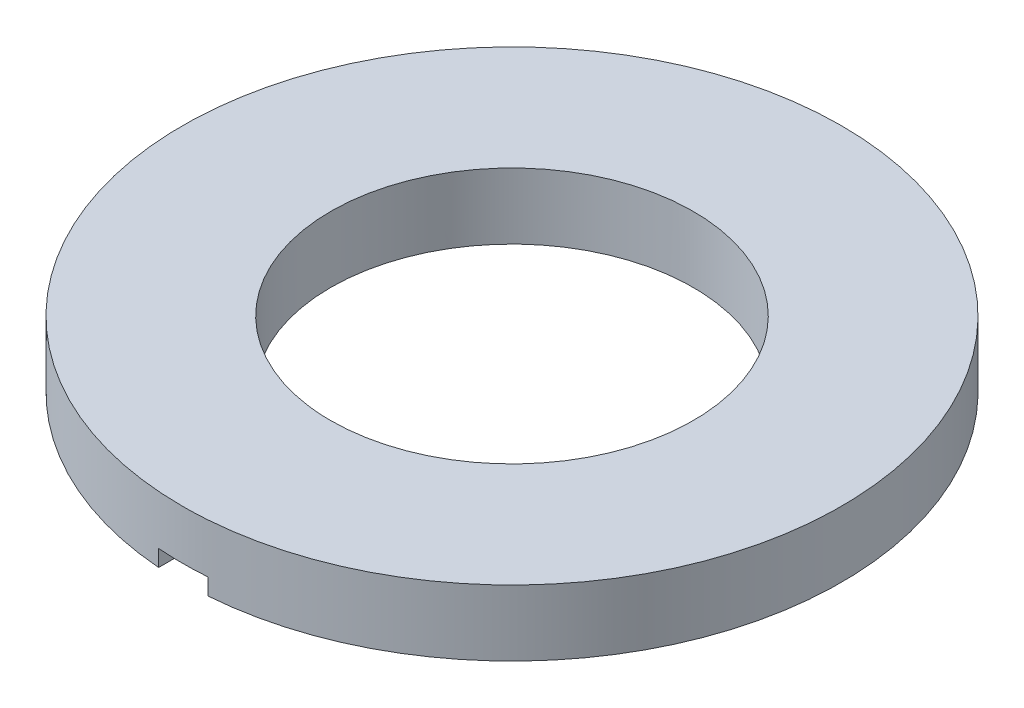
ISO-10303-21;
HEADER;
FILE_DESCRIPTION(('STEP AP214'),'2;1');
FILE_NAME('part.step','',(''),(''),'','','');
FILE_SCHEMA(('AUTOMOTIVE_DESIGN { 1 0 10303 214 1 1 1 1 }'));
ENDSEC;
DATA;
#1=APPLICATION_CONTEXT('core data for automotive mechanical design processes');
#2=APPLICATION_PROTOCOL_DEFINITION('international standard','automotive_design',2000,#1);
#3=PRODUCT_CONTEXT('',#1,'mechanical');
#4=PRODUCT('Part','Part','',(#3));
#5=PRODUCT_RELATED_PRODUCT_CATEGORY('part','',(#4));
#6=PRODUCT_DEFINITION_FORMATION('','',#4);
#7=PRODUCT_DEFINITION_CONTEXT('part definition',#1,'design');
#8=PRODUCT_DEFINITION('design','',#6,#7);
#9=PRODUCT_DEFINITION_SHAPE('','',#8);
#10=(LENGTH_UNIT() NAMED_UNIT(*) SI_UNIT(.MILLI.,.METRE.));
#11=(NAMED_UNIT(*) PLANE_ANGLE_UNIT() SI_UNIT($,.RADIAN.));
#12=(NAMED_UNIT(*) SI_UNIT($,.STERADIAN.) SOLID_ANGLE_UNIT());
#13=UNCERTAINTY_MEASURE_WITH_UNIT(LENGTH_MEASURE(1.E-05),#10,'distance_accuracy_value','');
#14=(GEOMETRIC_REPRESENTATION_CONTEXT(3) GLOBAL_UNCERTAINTY_ASSIGNED_CONTEXT((#13)) GLOBAL_UNIT_ASSIGNED_CONTEXT((#10,
#11,#12)) REPRESENTATION_CONTEXT('',''));
#15=CARTESIAN_POINT('',(0.,0.,0.));
#16=DIRECTION('',(0.,0.,1.));
#17=DIRECTION('',(1.,0.,0.));
#18=AXIS2_PLACEMENT_3D('',#15,#16,#17);
#19=CARTESIAN_POINT('',(0.,2.,0.));
#20=DIRECTION('',(0.,1.,0.));
#21=DIRECTION('',(0.,0.,1.));
#22=AXIS2_PLACEMENT_3D('',#19,#20,#21);
#23=PLANE('',#22);
#24=CARTESIAN_POINT('',(0.,2.,0.));
#25=DIRECTION('',(0.,1.,0.));
#26=DIRECTION('',(0.,0.,1.));
#27=AXIS2_PLACEMENT_3D('',#24,#25,#26);
#28=CIRCLE('',#27,10.);
#29=CARTESIAN_POINT('',(0.,2.,10.));
#30=VERTEX_POINT('',#29);
#31=EDGE_CURVE('E114',#30,#30,#28,.T.);
#32=ORIENTED_EDGE('',*,*,#31,.T.);
#33=EDGE_LOOP('',(#32));
#34=FACE_BOUND('',#33,.T.);
#35=CARTESIAN_POINT('',(0.,2.,0.));
#36=DIRECTION('',(0.,1.,0.));
#37=DIRECTION('',(0.,0.,1.));
#38=AXIS2_PLACEMENT_3D('',#35,#36,#37);
#39=CIRCLE('',#38,5.5);
#40=CARTESIAN_POINT('',(0.,2.,5.5));
#41=VERTEX_POINT('',#40);
#42=EDGE_CURVE('E102',#41,#41,#39,.T.);
#43=ORIENTED_EDGE('',*,*,#42,.F.);
#44=EDGE_LOOP('',(#43));
#45=FACE_BOUND('',#44,.T.);
#46=ADVANCED_FACE('F39',(#34,#45),#23,.T.);
#47=CARTESIAN_POINT('',(0.,0.,0.));
#48=DIRECTION('',(0.,1.,0.));
#49=DIRECTION('',(0.,0.,1.));
#50=AXIS2_PLACEMENT_3D('',#47,#48,#49);
#51=PLANE('',#50);
#52=CARTESIAN_POINT('',(0.,0.,0.));
#53=DIRECTION('',(0.,1.,0.));
#54=DIRECTION('',(0.,0.,1.));
#55=AXIS2_PLACEMENT_3D('',#52,#53,#54);
#56=CIRCLE('',#55,10.);
#57=CARTESIAN_POINT('',(0.75,0.,9.97183533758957));
#58=VERTEX_POINT('',#57);
#59=CARTESIAN_POINT('',(-0.75,0.,9.97183533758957));
#60=VERTEX_POINT('',#59);
#61=EDGE_CURVE('E94',#58,#60,#56,.T.);
#62=ORIENTED_EDGE('',*,*,#61,.F.);
#63=DIRECTION('',(0.,0.,1.));
#64=VECTOR('',#63,1.);
#65=CARTESIAN_POINT('',(0.75,0.,0.999999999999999));
#66=LINE('',#65,#64);
#67=CARTESIAN_POINT('',(0.75,0.,5.44862367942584));
#68=VERTEX_POINT('',#67);
#69=EDGE_CURVE('E81',#68,#58,#66,.T.);
#70=ORIENTED_EDGE('',*,*,#69,.F.);
#71=CARTESIAN_POINT('',(0.,0.,0.));
#72=DIRECTION('',(0.,1.,0.));
#73=DIRECTION('',(0.,0.,1.));
#74=AXIS2_PLACEMENT_3D('',#71,#72,#73);
#75=CIRCLE('',#74,5.5);
#76=CARTESIAN_POINT('',(-0.75,0.,5.44862367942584));
#77=VERTEX_POINT('',#76);
#78=EDGE_CURVE('E92',#68,#77,#75,.T.);
#79=ORIENTED_EDGE('',*,*,#78,.T.);
#80=DIRECTION('',(0.,0.,-1.));
#81=VECTOR('',#80,1.);
#82=CARTESIAN_POINT('',(-0.75,0.,0.999999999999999));
#83=LINE('',#82,#81);
#84=EDGE_CURVE('E96',#60,#77,#83,.T.);
#85=ORIENTED_EDGE('',*,*,#84,.F.);
#86=EDGE_LOOP('',(#62,#70,#79,#85));
#87=FACE_BOUND('',#86,.T.);
#88=ADVANCED_FACE('F90',(#87),#51,.F.);
#89=CARTESIAN_POINT('',(0.,2.,0.));
#90=DIRECTION('',(0.,-1.,0.));
#91=DIRECTION('',(0.,0.,-1.));
#92=AXIS2_PLACEMENT_3D('',#89,#90,#91);
#93=CYLINDRICAL_SURFACE('',#92,10.);
#94=ORIENTED_EDGE('',*,*,#31,.F.);
#95=EDGE_LOOP('',(#94));
#96=FACE_BOUND('',#95,.T.);
#97=CARTESIAN_POINT('',(0.,0.5,0.));
#98=DIRECTION('',(0.,1.,0.));
#99=DIRECTION('',(0.,0.,1.));
#100=AXIS2_PLACEMENT_3D('',#97,#98,#99);
#101=CIRCLE('',#100,10.);
#102=CARTESIAN_POINT('',(-0.75,0.5,9.97183533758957));
#103=VERTEX_POINT('',#102);
#104=CARTESIAN_POINT('',(0.75,0.5,9.97183533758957));
#105=VERTEX_POINT('',#104);
#106=EDGE_CURVE('E60',#103,#105,#101,.T.);
#107=ORIENTED_EDGE('',*,*,#106,.T.);
#108=DIRECTION('',(0.,-1.,0.));
#109=VECTOR('',#108,1.);
#110=CARTESIAN_POINT('',(0.75,2.,9.97183533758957));
#111=LINE('',#110,#109);
#112=EDGE_CURVE('E103',#105,#58,#111,.T.);
#113=ORIENTED_EDGE('',*,*,#112,.T.);
#114=ORIENTED_EDGE('',*,*,#61,.T.);
#115=DIRECTION('',(0.,-1.,0.));
#116=VECTOR('',#115,1.);
#117=CARTESIAN_POINT('',(-0.75,2.,9.97183533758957));
#118=LINE('',#117,#116);
#119=EDGE_CURVE('E111',#60,#103,#118,.F.);
#120=ORIENTED_EDGE('',*,*,#119,.T.);
#121=EDGE_LOOP('',(#107,#113,#114,#120));
#122=FACE_BOUND('',#121,.T.);
#123=ADVANCED_FACE('F41',(#96,#122),#93,.T.);
#124=CARTESIAN_POINT('',(0.,2.,0.));
#125=DIRECTION('',(0.,-1.,0.));
#126=DIRECTION('',(0.,0.,-1.));
#127=AXIS2_PLACEMENT_3D('',#124,#125,#126);
#128=CYLINDRICAL_SURFACE('',#127,5.5);
#129=DIRECTION('',(0.,-1.,0.));
#130=VECTOR('',#129,1.);
#131=CARTESIAN_POINT('',(0.75,2.,5.44862367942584));
#132=LINE('',#131,#130);
#133=CARTESIAN_POINT('',(0.75,0.5,5.44862367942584));
#134=VERTEX_POINT('',#133);
#135=EDGE_CURVE('E11',#134,#68,#132,.T.);
#136=ORIENTED_EDGE('',*,*,#135,.F.);
#137=CARTESIAN_POINT('',(0.,0.5,0.));
#138=DIRECTION('',(0.,1.,0.));
#139=DIRECTION('',(0.,0.,1.));
#140=AXIS2_PLACEMENT_3D('',#137,#138,#139);
#141=CIRCLE('',#140,5.5);
#142=CARTESIAN_POINT('',(-0.75,0.5,5.44862367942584));
#143=VERTEX_POINT('',#142);
#144=EDGE_CURVE('E118',#143,#134,#141,.T.);
#145=ORIENTED_EDGE('',*,*,#144,.F.);
#146=DIRECTION('',(0.,-1.,0.));
#147=VECTOR('',#146,1.);
#148=CARTESIAN_POINT('',(-0.75,2.,5.44862367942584));
#149=LINE('',#148,#147);
#150=EDGE_CURVE('E48',#77,#143,#149,.F.);
#151=ORIENTED_EDGE('',*,*,#150,.F.);
#152=ORIENTED_EDGE('',*,*,#78,.F.);
#153=EDGE_LOOP('',(#136,#145,#151,#152));
#154=FACE_BOUND('',#153,.T.);
#155=ORIENTED_EDGE('',*,*,#42,.T.);
#156=EDGE_LOOP('',(#155));
#157=FACE_BOUND('',#156,.T.);
#158=ADVANCED_FACE('F99',(#154,#157),#128,.F.);
#159=CARTESIAN_POINT('',(0.75,0.5,0.999999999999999));
#160=DIRECTION('',(1.,0.,0.));
#161=DIRECTION('',(0.,0.,-1.));
#162=AXIS2_PLACEMENT_3D('',#159,#160,#161);
#163=PLANE('',#162);
#164=DIRECTION('',(0.,0.,1.));
#165=VECTOR('',#164,1.);
#166=CARTESIAN_POINT('',(0.75,0.5,0.999999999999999));
#167=LINE('',#166,#165);
#168=EDGE_CURVE('E83',#134,#105,#167,.T.);
#169=ORIENTED_EDGE('',*,*,#168,.F.);
#170=ORIENTED_EDGE('',*,*,#135,.T.);
#171=ORIENTED_EDGE('',*,*,#69,.T.);
#172=ORIENTED_EDGE('',*,*,#112,.F.);
#173=EDGE_LOOP('',(#169,#170,#171,#172));
#174=FACE_BOUND('',#173,.T.);
#175=ADVANCED_FACE('F79',(#174),#163,.F.);
#176=CARTESIAN_POINT('',(-0.75,0.5,0.999999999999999));
#177=DIRECTION('',(-1.,0.,0.));
#178=DIRECTION('',(0.,0.,1.));
#179=AXIS2_PLACEMENT_3D('',#176,#177,#178);
#180=PLANE('',#179);
#181=ORIENTED_EDGE('',*,*,#84,.T.);
#182=ORIENTED_EDGE('',*,*,#150,.T.);
#183=DIRECTION('',(0.,0.,-1.));
#184=VECTOR('',#183,1.);
#185=CARTESIAN_POINT('',(-0.75,0.5,0.999999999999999));
#186=LINE('',#185,#184);
#187=EDGE_CURVE('E55',#103,#143,#186,.T.);
#188=ORIENTED_EDGE('',*,*,#187,.F.);
#189=ORIENTED_EDGE('',*,*,#119,.F.);
#190=EDGE_LOOP('',(#181,#182,#188,#189));
#191=FACE_BOUND('',#190,.T.);
#192=ADVANCED_FACE('F123',(#191),#180,.F.);
#193=CARTESIAN_POINT('',(0.,0.5,0.));
#194=DIRECTION('',(0.,1.,0.));
#195=DIRECTION('',(0.,0.,1.));
#196=AXIS2_PLACEMENT_3D('',#193,#194,#195);
#197=PLANE('',#196);
#198=ORIENTED_EDGE('',*,*,#106,.F.);
#199=ORIENTED_EDGE('',*,*,#187,.T.);
#200=ORIENTED_EDGE('',*,*,#144,.T.);
#201=ORIENTED_EDGE('',*,*,#168,.T.);
#202=EDGE_LOOP('',(#198,#199,#200,#201));
#203=FACE_BOUND('',#202,.T.);
#204=ADVANCED_FACE('F125',(#203),#197,.F.);
#205=CLOSED_SHELL('',(#46,#88,#123,#158,#175,#192,#204));
#206=MANIFOLD_SOLID_BREP('B2',#205);
#207=ADVANCED_BREP_SHAPE_REPRESENTATION('',(#18,#206),#14);
#208=SHAPE_DEFINITION_REPRESENTATION(#9,#207);
ENDSEC;
END-ISO-10303-21;
